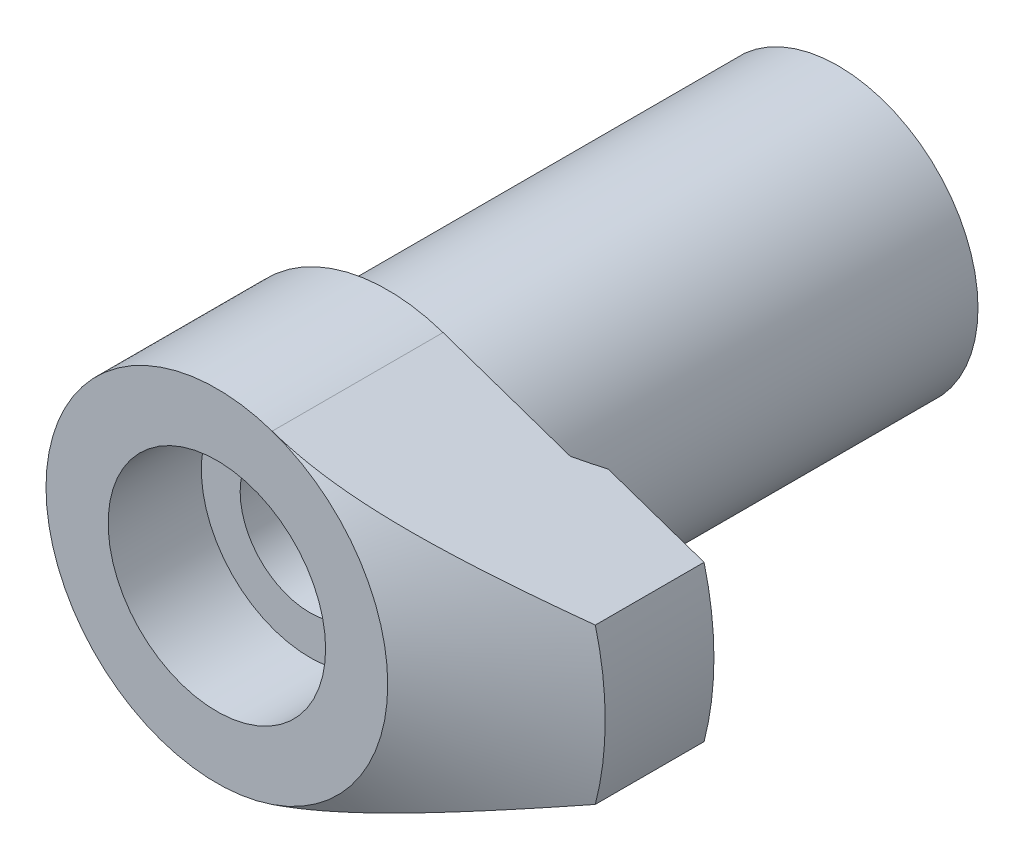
ISO-10303-21;
HEADER;
FILE_DESCRIPTION(('STEP AP214'),'2;1');
FILE_NAME('part.step','',(''),(''),'','','');
FILE_SCHEMA(('AUTOMOTIVE_DESIGN { 1 0 10303 214 1 1 1 1 }'));
ENDSEC;
DATA;
#1=APPLICATION_CONTEXT('core data for automotive mechanical design processes');
#2=APPLICATION_PROTOCOL_DEFINITION('international standard','automotive_design',2000,#1);
#3=PRODUCT_CONTEXT('',#1,'mechanical');
#4=PRODUCT('Part','Part','',(#3));
#5=PRODUCT_RELATED_PRODUCT_CATEGORY('part','',(#4));
#6=PRODUCT_DEFINITION_FORMATION('','',#4);
#7=PRODUCT_DEFINITION_CONTEXT('part definition',#1,'design');
#8=PRODUCT_DEFINITION('design','',#6,#7);
#9=PRODUCT_DEFINITION_SHAPE('','',#8);
#10=(LENGTH_UNIT() NAMED_UNIT(*) SI_UNIT(.MILLI.,.METRE.));
#11=(NAMED_UNIT(*) PLANE_ANGLE_UNIT() SI_UNIT($,.RADIAN.));
#12=(NAMED_UNIT(*) SI_UNIT($,.STERADIAN.) SOLID_ANGLE_UNIT());
#13=UNCERTAINTY_MEASURE_WITH_UNIT(LENGTH_MEASURE(1.E-05),#10,'distance_accuracy_value','');
#14=(GEOMETRIC_REPRESENTATION_CONTEXT(3) GLOBAL_UNCERTAINTY_ASSIGNED_CONTEXT((#13)) GLOBAL_UNIT_ASSIGNED_CONTEXT((#10,
#11,#12)) REPRESENTATION_CONTEXT('',''));
#15=CARTESIAN_POINT('',(0.,0.,0.));
#16=DIRECTION('',(0.,0.,1.));
#17=DIRECTION('',(1.,0.,0.));
#18=AXIS2_PLACEMENT_3D('',#15,#16,#17);
#19=CARTESIAN_POINT('',(19.3649167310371,5.,40.));
#20=DIRECTION('',(-0.323744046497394,-0.946144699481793,0.));
#21=DIRECTION('',(0.946144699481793,-0.323744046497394,0.));
#22=AXIS2_PLACEMENT_3D('',#19,#20,#21);
#23=PLANE('',#22);
#24=DIRECTION('',(0.946144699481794,-0.323744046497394,0.));
#25=VECTOR('',#24,1.);
#26=CARTESIAN_POINT('',(3.56118451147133,10.4075916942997,29.));
#27=LINE('',#26,#25);
#28=CARTESIAN_POINT('',(3.56118451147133,10.4075916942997,29.));
#29=VERTEX_POINT('',#28);
#30=CARTESIAN_POINT('',(11.7550379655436,7.60388600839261,29.));
#31=VERTEX_POINT('',#30);
#32=EDGE_CURVE('E75',#29,#31,#27,.T.);
#33=ORIENTED_EDGE('',*,*,#32,.F.);
#34=DIRECTION('',(0.,0.,-1.));
#35=VECTOR('',#34,1.);
#36=CARTESIAN_POINT('',(3.56118451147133,10.4075916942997,40.));
#37=LINE('',#36,#35);
#38=CARTESIAN_POINT('',(3.56118451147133,10.4075916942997,40.));
#39=VERTEX_POINT('',#38);
#40=EDGE_CURVE('E79',#39,#29,#37,.T.);
#41=ORIENTED_EDGE('',*,*,#40,.F.);
#42=CARTESIAN_POINT('',(19.3651167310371,4.99993156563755,34.9999019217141));
#43=CARTESIAN_POINT('',(19.1189011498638,5.08417959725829,35.1206409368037));
#44=CARTESIAN_POINT('',(18.8723799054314,5.16853221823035,35.2406833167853));
#45=CARTESIAN_POINT('',(18.378655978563,5.33747062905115,35.4792007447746));
#46=CARTESIAN_POINT('',(18.1314532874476,5.42205642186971,35.5976757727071));
#47=CARTESIAN_POINT('',(17.3886142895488,5.67623498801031,35.9505378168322));
#48=CARTESIAN_POINT('',(16.8918594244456,5.84621050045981,36.1823065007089));
#49=CARTESIAN_POINT('',(15.8908700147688,6.1887208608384,36.6387980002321));
#50=CARTESIAN_POINT('',(15.38660734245,6.36126533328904,36.8634521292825));
#51=CARTESIAN_POINT('',(14.3736636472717,6.70786611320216,37.3012836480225));
#52=CARTESIAN_POINT('',(13.8649829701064,6.8819223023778,37.5144619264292));
#53=CARTESIAN_POINT('',(12.8558826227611,7.2272079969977,37.920491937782));
#54=CARTESIAN_POINT('',(12.3556044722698,7.39838907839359,38.1137341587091));
#55=CARTESIAN_POINT('',(11.3489503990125,7.74283772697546,38.4820358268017));
#56=CARTESIAN_POINT('',(10.8425735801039,7.91610560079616,38.6570925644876));
#57=CARTESIAN_POINT('',(9.82459128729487,8.26443044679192,38.9830773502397));
#58=CARTESIAN_POINT('',(9.31300741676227,8.43948002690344,39.1340799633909));
#59=CARTESIAN_POINT('',(8.28274907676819,8.79200539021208,39.4059611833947));
#60=CARTESIAN_POINT('',(7.76407727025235,8.96948026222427,39.5268507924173));
#61=CARTESIAN_POINT('',(6.93982826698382,9.25151503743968,39.6882311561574));
#62=CARTESIAN_POINT('',(6.63641734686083,9.35533370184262,39.741148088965));
#63=CARTESIAN_POINT('',(6.02763820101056,9.56364076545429,39.8331116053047));
#64=CARTESIAN_POINT('',(5.72226960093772,9.66812929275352,39.872155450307));
#65=CARTESIAN_POINT('',(5.10799065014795,9.8783182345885,39.9354429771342));
#66=CARTESIAN_POINT('',(4.79907044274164,9.98402202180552,39.9595817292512));
#67=CARTESIAN_POINT('',(4.33512013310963,10.1427727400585,39.9837955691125));
#68=CARTESIAN_POINT('',(4.18035388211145,10.1957293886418,39.9898678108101));
#69=CARTESIAN_POINT('',(3.87072209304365,10.3016766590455,39.9979730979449));
#70=CARTESIAN_POINT('',(3.71585655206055,10.3546672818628,40.0000060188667));
#71=CARTESIAN_POINT('',(3.56098451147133,10.4076601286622,39.9999999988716));
#72=B_SPLINE_CURVE_WITH_KNOTS('',3,(#42,#43,#44,#45,#46,#47,#48,#49,#50,#51,#52,#53,#54,#55,#56,
#57,#58,#59,#60,#61,#62,#63,#64,#65,#66,#67,#68,#69,#70,#71),.UNSPECIFIED.,.F.,.F.,(4,2,2,2,2,2,
2,2,2,2,2,2,2,2,4),(0.,0.860625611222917,1.72126223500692,3.4429284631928,5.17796357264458,
6.9128641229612,8.60149286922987,10.2903728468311,11.9739110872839,13.6568333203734,
14.6316278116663,15.6066146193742,16.5883891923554,17.0794104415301,17.5704468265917),.UNSPECIFIED.);
#73=CARTESIAN_POINT('',(19.3649167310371,5.,35.));
#74=VERTEX_POINT('',#73);
#75=EDGE_CURVE('E142',#74,#39,#72,.T.);
#76=ORIENTED_EDGE('',*,*,#75,.F.);
#77=DIRECTION('',(0.,0.,-1.));
#78=VECTOR('',#77,1.);
#79=CARTESIAN_POINT('',(19.3649167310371,5.,40.));
#80=LINE('',#79,#78);
#81=CARTESIAN_POINT('',(19.3649167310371,5.,28.));
#82=VERTEX_POINT('',#81);
#83=EDGE_CURVE('E98',#74,#82,#80,.T.);
#84=ORIENTED_EDGE('',*,*,#83,.T.);
#85=DIRECTION('',(-0.946144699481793,0.323744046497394,0.));
#86=VECTOR('',#85,1.);
#87=CARTESIAN_POINT('',(19.3649167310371,5.,28.));
#88=LINE('',#87,#86);
#89=CARTESIAN_POINT('',(13.2100050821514,7.10603727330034,28.));
#90=VERTEX_POINT('',#89);
#91=EDGE_CURVE('E197',#82,#90,#88,.T.);
#92=ORIENTED_EDGE('',*,*,#91,.T.);
#93=CARTESIAN_POINT('',(23.8225206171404,3.4747335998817,18.9254021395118));
#94=CARTESIAN_POINT('',(23.5269580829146,3.57586676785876,19.2032639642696));
#95=CARTESIAN_POINT('',(23.2308068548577,3.67720137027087,19.4804279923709));
#96=CARTESIAN_POINT('',(22.6371636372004,3.88032934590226,20.0331547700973));
#97=CARTESIAN_POINT('',(22.3396716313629,3.98212272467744,20.3087175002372));
#98=CARTESIAN_POINT('',(21.7430806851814,4.18625932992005,20.8581305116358));
#99=CARTESIAN_POINT('',(21.443981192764,4.28860274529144,21.1319801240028));
#100=CARTESIAN_POINT('',(20.8440894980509,4.49386877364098,21.6775958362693));
#101=CARTESIAN_POINT('',(20.543297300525,4.59679138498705,21.9493619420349));
#102=CARTESIAN_POINT('',(19.62981066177,4.9093607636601,22.7685011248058));
#103=CARTESIAN_POINT('',(19.0141425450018,5.12002503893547,23.312194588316));
#104=CARTESIAN_POINT('',(18.0830184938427,5.43862944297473,24.1177590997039));
#105=CARTESIAN_POINT('',(17.7714030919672,5.54525544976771,24.3845934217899));
#106=CARTESIAN_POINT('',(17.1452054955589,5.75952261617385,24.9143498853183));
#107=CARTESIAN_POINT('',(16.8306233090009,5.86716377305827,25.1772720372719));
#108=CARTESIAN_POINT('',(16.2134223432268,6.07835254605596,25.6857928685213));
#109=CARTESIAN_POINT('',(15.9109663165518,6.18184447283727,25.9316119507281));
#110=CARTESIAN_POINT('',(15.302469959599,6.39005477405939,26.4182579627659));
#111=CARTESIAN_POINT('',(14.9964296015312,6.49477315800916,26.6590848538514));
#112=CARTESIAN_POINT('',(14.380009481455,6.70569474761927,27.1348982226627));
#113=CARTESIAN_POINT('',(14.0696271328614,6.81189883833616,27.3698809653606));
#114=CARTESIAN_POINT('',(13.444045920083,7.02595509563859,27.832580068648));
#115=CARTESIAN_POINT('',(13.1288471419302,7.13380723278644,28.0602965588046));
#116=CARTESIAN_POINT('',(12.4939671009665,7.35104528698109,28.5060566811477));
#117=CARTESIAN_POINT('',(12.1743055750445,7.46042445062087,28.7241316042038));
#118=CARTESIAN_POINT('',(11.5284990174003,7.68140125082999,29.1494069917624));
#119=CARTESIAN_POINT('',(11.2023533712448,7.79299909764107,29.3566064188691));
#120=CARTESIAN_POINT('',(10.5429830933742,8.01861702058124,29.7572101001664));
#121=CARTESIAN_POINT('',(10.2097663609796,8.13263439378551,29.950628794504));
#122=CARTESIAN_POINT('',(9.53501673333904,8.36351469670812,30.3204109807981));
#123=CARTESIAN_POINT('',(9.1934862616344,8.4803767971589,30.496779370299));
#124=CARTESIAN_POINT('',(8.52583347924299,8.70882875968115,30.8163307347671));
#125=CARTESIAN_POINT('',(8.20034552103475,8.82020156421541,30.9609824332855));
#126=CARTESIAN_POINT('',(7.54104904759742,9.0457942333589,31.2275642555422));
#127=CARTESIAN_POINT('',(7.20724056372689,9.16001408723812,31.3494944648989));
#128=CARTESIAN_POINT('',(6.53319028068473,9.39065509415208,31.5652989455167));
#129=CARTESIAN_POINT('',(6.19298575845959,9.50706349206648,31.6593014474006));
#130=CARTESIAN_POINT('',(5.50599141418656,9.74213359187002,31.8152095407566));
#131=CARTESIAN_POINT('',(5.15920246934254,9.86079499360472,31.8771193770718));
#132=CARTESIAN_POINT('',(4.45665752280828,10.101186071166,31.9655922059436));
#133=CARTESIAN_POINT('',(4.10084383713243,10.2229354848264,31.9916544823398));
#134=CARTESIAN_POINT('',(3.3885757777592,10.4666535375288,32.0049253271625));
#135=CARTESIAN_POINT('',(3.0321214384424,10.5886221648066,31.9921359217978));
#136=CARTESIAN_POINT('',(2.32116152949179,10.8318926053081,31.9285504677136));
#137=CARTESIAN_POINT('',(1.9666659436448,10.9531910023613,31.8776320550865));
#138=CARTESIAN_POINT('',(1.26374974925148,11.1937091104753,31.7411085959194));
#139=CARTESIAN_POINT('',(0.915330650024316,11.3129283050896,31.6554950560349));
#140=CARTESIAN_POINT('',(0.104046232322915,11.5905269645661,31.4187136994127));
#141=CARTESIAN_POINT('',(-0.355534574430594,11.7477825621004,31.2550634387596));
#142=CARTESIAN_POINT('',(-1.25915279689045,12.0569752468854,30.8854791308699));
#143=CARTESIAN_POINT('',(-1.70317927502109,12.2089085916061,30.6795160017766));
#144=CARTESIAN_POINT('',(-2.57753442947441,12.5080882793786,30.2355394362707));
#145=CARTESIAN_POINT('',(-3.00783403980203,12.6553246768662,29.99746293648));
#146=CARTESIAN_POINT('',(-3.85565904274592,12.9454264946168,29.4977073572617));
#147=CARTESIAN_POINT('',(-4.27318894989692,13.0882934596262,29.2360367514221));
#148=CARTESIAN_POINT('',(-4.82475924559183,13.277025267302,28.873978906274));
#149=CARTESIAN_POINT('',(-4.96350654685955,13.3245006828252,28.7814860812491));
#150=CARTESIAN_POINT('',(-5.23947978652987,13.418930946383,28.5948861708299));
#151=CARTESIAN_POINT('',(-5.37670889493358,13.4658868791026,28.5007843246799));
#152=CARTESIAN_POINT('',(-5.51341334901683,13.5126632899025,28.4058300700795));
#153=B_SPLINE_CURVE_WITH_KNOTS('',3,(#93,#94,#95,#96,#97,#98,#99,#100,#101,#102,#103,#104,#105,
#106,#107,#108,#109,#110,#111,#112,#113,#114,#115,#116,#117,#118,#119,#120,#121,#122,#123,#124,
#125,#126,#127,#128,#129,#130,#131,#132,#133,#134,#135,#136,#137,#138,#139,#140,#141,#142,#143,
#144,#145,#146,#147,#148,#149,#150,#151,#152),.UNSPECIFIED.,.F.,.F.,(4,2,2,2,2,2,2,2,2,2,2,2,2,
2,2,2,2,2,2,2,2,2,2,2,2,2,2,2,2,4),(0.,1.25424563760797,2.5085065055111,3.76322985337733,
5.01794966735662,7.56165901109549,8.83327508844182,10.1048877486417,11.3146219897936,
12.524365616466,13.7348635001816,14.9453397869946,16.1515456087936,17.3578662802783,
18.5629037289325,19.7675940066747,20.8865086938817,22.0054191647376,23.1191097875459,
24.2326530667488,25.3615974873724,26.4904830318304,27.6230070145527,28.7558084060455,
30.290783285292,31.8268167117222,33.3659117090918,34.9044561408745,35.4245803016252,
35.9432495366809),.UNSPECIFIED.);
#154=EDGE_CURVE('E82',#90,#31,#153,.T.);
#155=ORIENTED_EDGE('',*,*,#154,.T.);
#156=EDGE_LOOP('',(#33,#41,#76,#84,#92,#155));
#157=FACE_BOUND('',#156,.T.);
#158=ADVANCED_FACE('F14',(#157),#23,.F.);
#159=CARTESIAN_POINT('',(19.3649167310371,-5.,40.));
#160=DIRECTION('',(0.323744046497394,-0.946144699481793,0.));
#161=DIRECTION('',(0.946144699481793,0.323744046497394,0.));
#162=AXIS2_PLACEMENT_3D('',#159,#160,#161);
#163=PLANE('',#162);
#164=DIRECTION('',(0.,0.,-1.));
#165=VECTOR('',#164,1.);
#166=CARTESIAN_POINT('',(3.56118451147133,-10.4075916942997,40.));
#167=LINE('',#166,#165);
#168=CARTESIAN_POINT('',(3.56118451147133,-10.4075916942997,40.));
#169=VERTEX_POINT('',#168);
#170=CARTESIAN_POINT('',(3.56118451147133,-10.4075916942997,29.));
#171=VERTEX_POINT('',#170);
#172=EDGE_CURVE('E99',#169,#171,#167,.T.);
#173=ORIENTED_EDGE('',*,*,#172,.T.);
#174=DIRECTION('',(-0.946144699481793,-0.323744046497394,0.));
#175=VECTOR('',#174,1.);
#176=CARTESIAN_POINT('',(11.7550379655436,-7.6038860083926,29.));
#177=LINE('',#176,#175);
#178=CARTESIAN_POINT('',(11.7550379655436,-7.6038860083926,29.));
#179=VERTEX_POINT('',#178);
#180=EDGE_CURVE('E85',#179,#171,#177,.T.);
#181=ORIENTED_EDGE('',*,*,#180,.F.);
#182=CARTESIAN_POINT('',(23.8225206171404,-3.4747335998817,18.9254021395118));
#183=CARTESIAN_POINT('',(23.5269580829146,-3.57586676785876,19.2032639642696));
#184=CARTESIAN_POINT('',(23.2308068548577,-3.67720137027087,19.4804279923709));
#185=CARTESIAN_POINT('',(22.6371636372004,-3.88032934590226,20.0331547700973));
#186=CARTESIAN_POINT('',(22.3396716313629,-3.98212272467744,20.3087175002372));
#187=CARTESIAN_POINT('',(21.7430806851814,-4.18625932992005,20.8581305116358));
#188=CARTESIAN_POINT('',(21.443981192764,-4.28860274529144,21.1319801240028));
#189=CARTESIAN_POINT('',(20.8440894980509,-4.49386877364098,21.6775958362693));
#190=CARTESIAN_POINT('',(20.543297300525,-4.59679138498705,21.9493619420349));
#191=CARTESIAN_POINT('',(19.62981066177,-4.9093607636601,22.7685011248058));
#192=CARTESIAN_POINT('',(19.0141425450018,-5.12002503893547,23.312194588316));
#193=CARTESIAN_POINT('',(18.0830184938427,-5.43862944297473,24.1177590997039));
#194=CARTESIAN_POINT('',(17.7714030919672,-5.54525544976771,24.3845934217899));
#195=CARTESIAN_POINT('',(17.1452054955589,-5.75952261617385,24.9143498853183));
#196=CARTESIAN_POINT('',(16.8306233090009,-5.86716377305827,25.1772720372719));
#197=CARTESIAN_POINT('',(16.2134223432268,-6.07835254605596,25.6857928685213));
#198=CARTESIAN_POINT('',(15.9109663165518,-6.18184447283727,25.9316119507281));
#199=CARTESIAN_POINT('',(15.302469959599,-6.39005477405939,26.4182579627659));
#200=CARTESIAN_POINT('',(14.9964296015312,-6.49477315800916,26.6590848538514));
#201=CARTESIAN_POINT('',(14.380009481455,-6.70569474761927,27.1348982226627));
#202=CARTESIAN_POINT('',(14.0696271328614,-6.81189883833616,27.3698809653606));
#203=CARTESIAN_POINT('',(13.444045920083,-7.02595509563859,27.832580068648));
#204=CARTESIAN_POINT('',(13.1288471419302,-7.13380723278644,28.0602965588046));
#205=CARTESIAN_POINT('',(12.4939671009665,-7.35104528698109,28.5060566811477));
#206=CARTESIAN_POINT('',(12.1743055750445,-7.46042445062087,28.7241316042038));
#207=CARTESIAN_POINT('',(11.5284990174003,-7.68140125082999,29.1494069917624));
#208=CARTESIAN_POINT('',(11.2023533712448,-7.79299909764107,29.3566064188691));
#209=CARTESIAN_POINT('',(10.5429830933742,-8.01861702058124,29.7572101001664));
#210=CARTESIAN_POINT('',(10.2097663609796,-8.13263439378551,29.950628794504));
#211=CARTESIAN_POINT('',(9.53501673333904,-8.36351469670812,30.3204109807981));
#212=CARTESIAN_POINT('',(9.1934862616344,-8.4803767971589,30.496779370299));
#213=CARTESIAN_POINT('',(8.52583347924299,-8.70882875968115,30.8163307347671));
#214=CARTESIAN_POINT('',(8.20034552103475,-8.82020156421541,30.9609824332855));
#215=CARTESIAN_POINT('',(7.54104904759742,-9.0457942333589,31.2275642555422));
#216=CARTESIAN_POINT('',(7.20724056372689,-9.16001408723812,31.3494944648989));
#217=CARTESIAN_POINT('',(6.53319028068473,-9.39065509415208,31.5652989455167));
#218=CARTESIAN_POINT('',(6.19298575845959,-9.50706349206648,31.6593014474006));
#219=CARTESIAN_POINT('',(5.50599141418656,-9.74213359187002,31.8152095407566));
#220=CARTESIAN_POINT('',(5.15920246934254,-9.86079499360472,31.8771193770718));
#221=CARTESIAN_POINT('',(4.45665752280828,-10.101186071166,31.9655922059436));
#222=CARTESIAN_POINT('',(4.10084383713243,-10.2229354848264,31.9916544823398));
#223=CARTESIAN_POINT('',(3.3885757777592,-10.4666535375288,32.0049253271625));
#224=CARTESIAN_POINT('',(3.0321214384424,-10.5886221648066,31.9921359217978));
#225=CARTESIAN_POINT('',(2.32116152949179,-10.8318926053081,31.9285504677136));
#226=CARTESIAN_POINT('',(1.9666659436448,-10.9531910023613,31.8776320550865));
#227=CARTESIAN_POINT('',(1.26374974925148,-11.1937091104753,31.7411085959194));
#228=CARTESIAN_POINT('',(0.915330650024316,-11.3129283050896,31.6554950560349));
#229=CARTESIAN_POINT('',(0.104046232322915,-11.5905269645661,31.4187136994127));
#230=CARTESIAN_POINT('',(-0.355534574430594,-11.7477825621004,31.2550634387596));
#231=CARTESIAN_POINT('',(-1.25915279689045,-12.0569752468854,30.8854791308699));
#232=CARTESIAN_POINT('',(-1.70317927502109,-12.2089085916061,30.6795160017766));
#233=CARTESIAN_POINT('',(-2.57753442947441,-12.5080882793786,30.2355394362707));
#234=CARTESIAN_POINT('',(-3.00783403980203,-12.6553246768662,29.99746293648));
#235=CARTESIAN_POINT('',(-3.85565904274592,-12.9454264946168,29.4977073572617));
#236=CARTESIAN_POINT('',(-4.27318894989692,-13.0882934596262,29.2360367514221));
#237=CARTESIAN_POINT('',(-4.82475924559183,-13.277025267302,28.873978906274));
#238=CARTESIAN_POINT('',(-4.96350654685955,-13.3245006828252,28.7814860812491));
#239=CARTESIAN_POINT('',(-5.23947978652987,-13.418930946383,28.5948861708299));
#240=CARTESIAN_POINT('',(-5.37670889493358,-13.4658868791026,28.5007843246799));
#241=CARTESIAN_POINT('',(-5.51341334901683,-13.5126632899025,28.4058300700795));
#242=B_SPLINE_CURVE_WITH_KNOTS('',3,(#182,#183,#184,#185,#186,#187,#188,#189,#190,#191,#192,
#193,#194,#195,#196,#197,#198,#199,#200,#201,#202,#203,#204,#205,#206,#207,#208,#209,#210,#211,
#212,#213,#214,#215,#216,#217,#218,#219,#220,#221,#222,#223,#224,#225,#226,#227,#228,#229,#230,
#231,#232,#233,#234,#235,#236,#237,#238,#239,#240,#241),.UNSPECIFIED.,.F.,.F.,(4,2,2,2,2,2,2,2,
2,2,2,2,2,2,2,2,2,2,2,2,2,2,2,2,2,2,2,2,2,4),(0.,1.25424563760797,2.5085065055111,
3.76322985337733,5.01794966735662,7.56165901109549,8.83327508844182,10.1048877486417,
11.3146219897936,12.524365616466,13.7348635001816,14.9453397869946,16.1515456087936,
17.3578662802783,18.5629037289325,19.7675940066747,20.8865086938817,22.0054191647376,
23.1191097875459,24.2326530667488,25.3615974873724,26.4904830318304,27.6230070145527,
28.7558084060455,30.290783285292,31.8268167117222,33.3659117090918,34.9044561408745,
35.4245803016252,35.9432495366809),.UNSPECIFIED.);
#243=CARTESIAN_POINT('',(13.2100050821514,-7.10603727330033,28.));
#244=VERTEX_POINT('',#243);
#245=EDGE_CURVE('E9',#244,#179,#242,.T.);
#246=ORIENTED_EDGE('',*,*,#245,.F.);
#247=DIRECTION('',(-0.946144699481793,-0.323744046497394,0.));
#248=VECTOR('',#247,1.);
#249=CARTESIAN_POINT('',(19.3649167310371,-5.,28.));
#250=LINE('',#249,#248);
#251=CARTESIAN_POINT('',(19.3649167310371,-5.,28.));
#252=VERTEX_POINT('',#251);
#253=EDGE_CURVE('E28',#252,#244,#250,.T.);
#254=ORIENTED_EDGE('',*,*,#253,.F.);
#255=DIRECTION('',(0.,0.,-1.));
#256=VECTOR('',#255,1.);
#257=CARTESIAN_POINT('',(19.3649167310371,-5.,40.));
#258=LINE('',#257,#256);
#259=CARTESIAN_POINT('',(19.3649167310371,-5.,35.));
#260=VERTEX_POINT('',#259);
#261=EDGE_CURVE('E42',#260,#252,#258,.T.);
#262=ORIENTED_EDGE('',*,*,#261,.F.);
#263=CARTESIAN_POINT('',(19.3651167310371,-4.99993156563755,34.9999019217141));
#264=CARTESIAN_POINT('',(19.1189011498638,-5.08417959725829,35.1206409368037));
#265=CARTESIAN_POINT('',(18.8723799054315,-5.16853221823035,35.2406833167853));
#266=CARTESIAN_POINT('',(18.378655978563,-5.33747062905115,35.4792007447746));
#267=CARTESIAN_POINT('',(18.1314532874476,-5.42205642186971,35.5976757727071));
#268=CARTESIAN_POINT('',(17.3886142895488,-5.67623498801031,35.9505378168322));
#269=CARTESIAN_POINT('',(16.8918594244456,-5.84621050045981,36.1823065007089));
#270=CARTESIAN_POINT('',(15.8908700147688,-6.1887208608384,36.6387980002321));
#271=CARTESIAN_POINT('',(15.38660734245,-6.36126533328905,36.8634521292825));
#272=CARTESIAN_POINT('',(14.3736636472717,-6.70786611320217,37.3012836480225));
#273=CARTESIAN_POINT('',(13.8649829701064,-6.8819223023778,37.5144619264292));
#274=CARTESIAN_POINT('',(12.8558826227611,-7.2272079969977,37.920491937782));
#275=CARTESIAN_POINT('',(12.3556044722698,-7.3983890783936,38.1137341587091));
#276=CARTESIAN_POINT('',(11.3489503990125,-7.74283772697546,38.4820358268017));
#277=CARTESIAN_POINT('',(10.8425735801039,-7.91610560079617,38.6570925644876));
#278=CARTESIAN_POINT('',(9.82459128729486,-8.26443044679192,38.9830773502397));
#279=CARTESIAN_POINT('',(9.31300741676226,-8.43948002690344,39.1340799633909));
#280=CARTESIAN_POINT('',(8.28274907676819,-8.79200539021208,39.4059611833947));
#281=CARTESIAN_POINT('',(7.76407727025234,-8.96948026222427,39.5268507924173));
#282=CARTESIAN_POINT('',(6.93982826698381,-9.25151503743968,39.6882311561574));
#283=CARTESIAN_POINT('',(6.63641734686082,-9.35533370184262,39.741148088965));
#284=CARTESIAN_POINT('',(6.02763820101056,-9.56364076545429,39.8331116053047));
#285=CARTESIAN_POINT('',(5.72226960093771,-9.66812929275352,39.872155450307));
#286=CARTESIAN_POINT('',(5.10799065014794,-9.8783182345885,39.9354429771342));
#287=CARTESIAN_POINT('',(4.79907044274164,-9.98402202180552,39.9595817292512));
#288=CARTESIAN_POINT('',(4.33512013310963,-10.1427727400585,39.9837955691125));
#289=CARTESIAN_POINT('',(4.18035388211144,-10.1957293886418,39.9898678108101));
#290=CARTESIAN_POINT('',(3.87072209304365,-10.3016766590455,39.9979730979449));
#291=CARTESIAN_POINT('',(3.71585655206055,-10.3546672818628,40.0000060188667));
#292=CARTESIAN_POINT('',(3.56098451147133,-10.4076601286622,39.9999999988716));
#293=B_SPLINE_CURVE_WITH_KNOTS('',3,(#263,#264,#265,#266,#267,#268,#269,#270,#271,#272,#273,
#274,#275,#276,#277,#278,#279,#280,#281,#282,#283,#284,#285,#286,#287,#288,#289,#290,#291,#292),
.UNSPECIFIED.,.F.,.F.,(4,2,2,2,2,2,2,2,2,2,2,2,2,2,4),(0.,0.860625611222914,1.72126223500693,
3.44292846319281,5.17796357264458,6.91286412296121,8.60149286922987,10.2903728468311,
11.9739110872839,13.6568333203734,14.6316278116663,15.6066146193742,16.5883891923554,
17.0794104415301,17.5704468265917),.UNSPECIFIED.);
#294=EDGE_CURVE('E134',#260,#169,#293,.T.);
#295=ORIENTED_EDGE('',*,*,#294,.T.);
#296=EDGE_LOOP('',(#173,#181,#246,#254,#262,#295));
#297=FACE_BOUND('',#296,.T.);
#298=ADVANCED_FACE('F148',(#297),#163,.T.);
#299=CARTESIAN_POINT('',(0.,0.,40.));
#300=DIRECTION('',(0.,0.,-1.));
#301=DIRECTION('',(-1.,0.,0.));
#302=AXIS2_PLACEMENT_3D('',#299,#300,#301);
#303=CYLINDRICAL_SURFACE('',#302,11.);
#304=CARTESIAN_POINT('',(0.,0.,29.));
#305=DIRECTION('',(0.,0.,1.));
#306=DIRECTION('',(1.,0.,0.));
#307=AXIS2_PLACEMENT_3D('',#304,#305,#306);
#308=CIRCLE('',#307,11.);
#309=EDGE_CURVE('E88',#29,#171,#308,.T.);
#310=ORIENTED_EDGE('',*,*,#309,.T.);
#311=ORIENTED_EDGE('',*,*,#172,.F.);
#312=CARTESIAN_POINT('',(0.,0.,40.));
#313=DIRECTION('',(0.,0.,1.));
#314=DIRECTION('',(1.,0.,0.));
#315=AXIS2_PLACEMENT_3D('',#312,#313,#314);
#316=CIRCLE('',#315,11.);
#317=EDGE_CURVE('E97',#39,#169,#316,.T.);
#318=ORIENTED_EDGE('',*,*,#317,.F.);
#319=ORIENTED_EDGE('',*,*,#40,.T.);
#320=EDGE_LOOP('',(#310,#311,#318,#319));
#321=FACE_BOUND('',#320,.T.);
#322=ADVANCED_FACE('F96',(#321),#303,.T.);
#323=CARTESIAN_POINT('',(30.,20.,28.));
#324=DIRECTION('',(0.,0.,1.));
#325=DIRECTION('',(1.,0.,0.));
#326=AXIS2_PLACEMENT_3D('',#323,#324,#325);
#327=PLANE('',#326);
#328=ORIENTED_EDGE('',*,*,#253,.T.);
#329=CARTESIAN_POINT('',(0.,0.,28.));
#330=DIRECTION('',(0.,0.,1.));
#331=DIRECTION('',(1.,0.,0.));
#332=AXIS2_PLACEMENT_3D('',#329,#330,#331);
#333=CIRCLE('',#332,15.);
#334=EDGE_CURVE('E34',#244,#90,#333,.T.);
#335=ORIENTED_EDGE('',*,*,#334,.T.);
#336=ORIENTED_EDGE('',*,*,#91,.F.);
#337=CARTESIAN_POINT('',(0.,0.,28.));
#338=DIRECTION('',(0.,0.,1.));
#339=DIRECTION('',(1.,0.,0.));
#340=AXIS2_PLACEMENT_3D('',#337,#338,#339);
#341=CIRCLE('',#340,20.);
#342=EDGE_CURVE('E195',#252,#82,#341,.T.);
#343=ORIENTED_EDGE('',*,*,#342,.F.);
#344=EDGE_LOOP('',(#328,#335,#336,#343));
#345=FACE_BOUND('',#344,.T.);
#346=ADVANCED_FACE('F166',(#345),#327,.F.);
#347=CARTESIAN_POINT('',(0.,0.,0.));
#348=DIRECTION('',(0.,0.,-1.));
#349=DIRECTION('',(-1.,0.,0.));
#350=AXIS2_PLACEMENT_3D('',#347,#348,#349);
#351=CYLINDRICAL_SURFACE('',#350,4.5);
#352=CARTESIAN_POINT('',(0.,0.,24.));
#353=DIRECTION('',(0.,0.,-1.));
#354=DIRECTION('',(-1.,0.,0.));
#355=AXIS2_PLACEMENT_3D('',#352,#353,#354);
#356=CIRCLE('',#355,4.5);
#357=CARTESIAN_POINT('',(-4.5,0.,24.));
#358=VERTEX_POINT('',#357);
#359=EDGE_CURVE('E126',#358,#358,#356,.T.);
#360=ORIENTED_EDGE('',*,*,#359,.T.);
#361=EDGE_LOOP('',(#360));
#362=FACE_BOUND('',#361,.T.);
#363=CARTESIAN_POINT('',(0.,0.,34.));
#364=DIRECTION('',(0.,0.,1.));
#365=DIRECTION('',(1.,0.,0.));
#366=AXIS2_PLACEMENT_3D('',#363,#364,#365);
#367=CIRCLE('',#366,4.5);
#368=CARTESIAN_POINT('',(4.5,0.,34.));
#369=VERTEX_POINT('',#368);
#370=EDGE_CURVE('E106',#369,#369,#367,.T.);
#371=ORIENTED_EDGE('',*,*,#370,.T.);
#372=EDGE_LOOP('',(#371));
#373=FACE_BOUND('',#372,.T.);
#374=ADVANCED_FACE('F159',(#362,#373),#351,.F.);
#375=CARTESIAN_POINT('',(0.,0.,0.));
#376=DIRECTION('',(0.,0.,1.));
#377=DIRECTION('',(1.,0.,0.));
#378=AXIS2_PLACEMENT_3D('',#375,#376,#377);
#379=PLANE('',#378);
#380=CARTESIAN_POINT('',(0.,0.,0.));
#381=DIRECTION('',(0.,0.,-1.));
#382=DIRECTION('',(-1.,0.,0.));
#383=AXIS2_PLACEMENT_3D('',#380,#381,#382);
#384=CIRCLE('',#383,9.);
#385=CARTESIAN_POINT('',(-9.,0.,0.));
#386=VERTEX_POINT('',#385);
#387=EDGE_CURVE('E198',#386,#386,#384,.T.);
#388=ORIENTED_EDGE('',*,*,#387,.T.);
#389=EDGE_LOOP('',(#388));
#390=FACE_BOUND('',#389,.T.);
#391=CARTESIAN_POINT('',(0.,0.,0.));
#392=DIRECTION('',(0.,0.,-1.));
#393=DIRECTION('',(-1.,0.,0.));
#394=AXIS2_PLACEMENT_3D('',#391,#392,#393);
#395=CIRCLE('',#394,7.);
#396=CARTESIAN_POINT('',(-7.,0.,0.));
#397=VERTEX_POINT('',#396);
#398=EDGE_CURVE('E108',#397,#397,#395,.T.);
#399=ORIENTED_EDGE('',*,*,#398,.F.);
#400=EDGE_LOOP('',(#399));
#401=FACE_BOUND('',#400,.T.);
#402=ADVANCED_FACE('F170',(#390,#401),#379,.F.);
#403=CARTESIAN_POINT('',(0.,0.,40.));
#404=DIRECTION('',(0.,0.,1.));
#405=DIRECTION('',(1.,0.,0.));
#406=AXIS2_PLACEMENT_3D('',#403,#404,#405);
#407=PLANE('',#406);
#408=CARTESIAN_POINT('',(0.,0.,40.));
#409=DIRECTION('',(0.,0.,1.));
#410=DIRECTION('',(1.,0.,0.));
#411=AXIS2_PLACEMENT_3D('',#408,#409,#410);
#412=CIRCLE('',#411,7.);
#413=CARTESIAN_POINT('',(7.,0.,40.));
#414=VERTEX_POINT('',#413);
#415=EDGE_CURVE('E116',#414,#414,#412,.T.);
#416=ORIENTED_EDGE('',*,*,#415,.F.);
#417=EDGE_LOOP('',(#416));
#418=FACE_BOUND('',#417,.T.);
#419=ORIENTED_EDGE('',*,*,#317,.T.);
#420=CARTESIAN_POINT('',(0.,0.,40.));
#421=DIRECTION('',(0.,0.,1.));
#422=DIRECTION('',(1.,0.,0.));
#423=AXIS2_PLACEMENT_3D('',#420,#421,#422);
#424=CIRCLE('',#423,11.);
#425=EDGE_CURVE('E131',#169,#39,#424,.T.);
#426=ORIENTED_EDGE('',*,*,#425,.T.);
#427=EDGE_LOOP('',(#419,#426));
#428=FACE_BOUND('',#427,.T.);
#429=ADVANCED_FACE('F173',(#418,#428),#407,.T.);
#430=CARTESIAN_POINT('',(0.,0.,40.));
#431=DIRECTION('',(0.,0.,-1.));
#432=DIRECTION('',(-1.,0.,0.));
#433=AXIS2_PLACEMENT_3D('',#430,#431,#432);
#434=CYLINDRICAL_SURFACE('',#433,20.);
#435=CARTESIAN_POINT('',(0.,0.,35.));
#436=DIRECTION('',(0.,0.,1.));
#437=DIRECTION('',(1.,0.,0.));
#438=AXIS2_PLACEMENT_3D('',#435,#436,#437);
#439=CIRCLE('',#438,20.);
#440=EDGE_CURVE('E129',#260,#74,#439,.T.);
#441=ORIENTED_EDGE('',*,*,#440,.F.);
#442=ORIENTED_EDGE('',*,*,#261,.T.);
#443=ORIENTED_EDGE('',*,*,#342,.T.);
#444=ORIENTED_EDGE('',*,*,#83,.F.);
#445=EDGE_LOOP('',(#441,#442,#443,#444));
#446=FACE_BOUND('',#445,.T.);
#447=ADVANCED_FACE('F164',(#446),#434,.T.);
#448=CARTESIAN_POINT('',(0.,0.,28.));
#449=DIRECTION('',(0.,0.,-1.));
#450=DIRECTION('',(-1.,0.,0.));
#451=AXIS2_PLACEMENT_3D('',#448,#449,#450);
#452=CYLINDRICAL_SURFACE('',#451,9.);
#453=ORIENTED_EDGE('',*,*,#387,.F.);
#454=EDGE_LOOP('',(#453));
#455=FACE_BOUND('',#454,.T.);
#456=CARTESIAN_POINT('',(0.,0.,29.));
#457=DIRECTION('',(0.,0.,1.));
#458=DIRECTION('',(1.,0.,0.));
#459=AXIS2_PLACEMENT_3D('',#456,#457,#458);
#460=CIRCLE('',#459,9.);
#461=CARTESIAN_POINT('',(9.,0.,29.));
#462=VERTEX_POINT('',#461);
#463=EDGE_CURVE('E94',#462,#462,#460,.T.);
#464=ORIENTED_EDGE('',*,*,#463,.F.);
#465=EDGE_LOOP('',(#464));
#466=FACE_BOUND('',#465,.T.);
#467=ADVANCED_FACE('F157',(#455,#466),#452,.T.);
#468=CARTESIAN_POINT('',(0.,0.,40.));
#469=DIRECTION('',(0.,0.,-1.));
#470=DIRECTION('',(-1.,0.,0.));
#471=AXIS2_PLACEMENT_3D('',#468,#469,#470);
#472=CONICAL_SURFACE('',#471,11.,1.06369782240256);
#473=ORIENTED_EDGE('',*,*,#75,.T.);
#474=ORIENTED_EDGE('',*,*,#425,.F.);
#475=ORIENTED_EDGE('',*,*,#294,.F.);
#476=ORIENTED_EDGE('',*,*,#440,.T.);
#477=EDGE_LOOP('',(#473,#474,#475,#476));
#478=FACE_BOUND('',#477,.T.);
#479=ADVANCED_FACE('F151',(#478),#472,.T.);
#480=CARTESIAN_POINT('',(4.5,0.,24.));
#481=DIRECTION('',(0.,0.,-1.));
#482=DIRECTION('',(-1.,0.,0.));
#483=AXIS2_PLACEMENT_3D('',#480,#481,#482);
#484=PLANE('',#483);
#485=CARTESIAN_POINT('',(0.,0.,24.));
#486=DIRECTION('',(0.,0.,-1.));
#487=DIRECTION('',(-1.,0.,0.));
#488=AXIS2_PLACEMENT_3D('',#485,#486,#487);
#489=CIRCLE('',#488,7.);
#490=CARTESIAN_POINT('',(-7.,0.,24.));
#491=VERTEX_POINT('',#490);
#492=EDGE_CURVE('E113',#491,#491,#489,.T.);
#493=ORIENTED_EDGE('',*,*,#492,.T.);
#494=EDGE_LOOP('',(#493));
#495=FACE_BOUND('',#494,.T.);
#496=ORIENTED_EDGE('',*,*,#359,.F.);
#497=EDGE_LOOP('',(#496));
#498=FACE_BOUND('',#497,.T.);
#499=ADVANCED_FACE('F156',(#495,#498),#484,.T.);
#500=CARTESIAN_POINT('',(0.,0.,0.));
#501=DIRECTION('',(0.,0.,-1.));
#502=DIRECTION('',(-1.,0.,0.));
#503=AXIS2_PLACEMENT_3D('',#500,#501,#502);
#504=CYLINDRICAL_SURFACE('',#503,7.);
#505=ORIENTED_EDGE('',*,*,#398,.T.);
#506=EDGE_LOOP('',(#505));
#507=FACE_BOUND('',#506,.T.);
#508=ORIENTED_EDGE('',*,*,#492,.F.);
#509=EDGE_LOOP('',(#508));
#510=FACE_BOUND('',#509,.T.);
#511=ADVANCED_FACE('F230',(#507,#510),#504,.F.);
#512=CARTESIAN_POINT('',(0.,0.,34.));
#513=DIRECTION('',(0.,0.,1.));
#514=DIRECTION('',(1.,0.,0.));
#515=AXIS2_PLACEMENT_3D('',#512,#513,#514);
#516=CYLINDRICAL_SURFACE('',#515,7.);
#517=CARTESIAN_POINT('',(0.,0.,34.));
#518=DIRECTION('',(0.,0.,1.));
#519=DIRECTION('',(1.,0.,0.));
#520=AXIS2_PLACEMENT_3D('',#517,#518,#519);
#521=CIRCLE('',#520,7.);
#522=CARTESIAN_POINT('',(7.,0.,34.));
#523=VERTEX_POINT('',#522);
#524=EDGE_CURVE('E109',#523,#523,#521,.T.);
#525=ORIENTED_EDGE('',*,*,#524,.F.);
#526=EDGE_LOOP('',(#525));
#527=FACE_BOUND('',#526,.T.);
#528=ORIENTED_EDGE('',*,*,#415,.T.);
#529=EDGE_LOOP('',(#528));
#530=FACE_BOUND('',#529,.T.);
#531=ADVANCED_FACE('F226',(#527,#530),#516,.F.);
#532=CARTESIAN_POINT('',(0.,0.,34.));
#533=DIRECTION('',(0.,0.,1.));
#534=DIRECTION('',(1.,0.,0.));
#535=AXIS2_PLACEMENT_3D('',#532,#533,#534);
#536=PLANE('',#535);
#537=ORIENTED_EDGE('',*,*,#370,.F.);
#538=EDGE_LOOP('',(#537));
#539=FACE_BOUND('',#538,.T.);
#540=ORIENTED_EDGE('',*,*,#524,.T.);
#541=EDGE_LOOP('',(#540));
#542=FACE_BOUND('',#541,.T.);
#543=ADVANCED_FACE('F225',(#539,#542),#536,.T.);
#544=CARTESIAN_POINT('',(-9.,0.,29.));
#545=DIRECTION('',(0.,0.,-1.));
#546=DIRECTION('',(-1.,0.,0.));
#547=AXIS2_PLACEMENT_3D('',#544,#545,#546);
#548=PLANE('',#547);
#549=ORIENTED_EDGE('',*,*,#463,.T.);
#550=EDGE_LOOP('',(#549));
#551=FACE_BOUND('',#550,.T.);
#552=ORIENTED_EDGE('',*,*,#309,.F.);
#553=ORIENTED_EDGE('',*,*,#32,.T.);
#554=CARTESIAN_POINT('',(0.,0.,29.));
#555=DIRECTION('',(0.,0.,1.));
#556=DIRECTION('',(1.,0.,0.));
#557=AXIS2_PLACEMENT_3D('',#554,#555,#556);
#558=CIRCLE('',#557,14.);
#559=EDGE_CURVE('E216',#179,#31,#558,.T.);
#560=ORIENTED_EDGE('',*,*,#559,.F.);
#561=ORIENTED_EDGE('',*,*,#180,.T.);
#562=EDGE_LOOP('',(#552,#553,#560,#561));
#563=FACE_BOUND('',#562,.T.);
#564=ADVANCED_FACE('F89',(#551,#563),#548,.T.);
#565=CARTESIAN_POINT('',(0.,0.,29.));
#566=DIRECTION('',(0.,0.,-1.));
#567=DIRECTION('',(-1.,0.,0.));
#568=AXIS2_PLACEMENT_3D('',#565,#566,#567);
#569=CONICAL_SURFACE('',#568,14.,0.785398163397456);
#570=ORIENTED_EDGE('',*,*,#334,.F.);
#571=ORIENTED_EDGE('',*,*,#245,.T.);
#572=ORIENTED_EDGE('',*,*,#559,.T.);
#573=ORIENTED_EDGE('',*,*,#154,.F.);
#574=EDGE_LOOP('',(#570,#571,#572,#573));
#575=FACE_BOUND('',#574,.T.);
#576=ADVANCED_FACE('F218',(#575),#569,.F.);
#577=CLOSED_SHELL('',(#158,#298,#322,#346,#374,#402,#429,#447,#467,#479,#499,#511,#531,#543,
#564,#576));
#578=MANIFOLD_SOLID_BREP('B1',#577);
#579=ADVANCED_BREP_SHAPE_REPRESENTATION('',(#18,#578),#14);
#580=SHAPE_DEFINITION_REPRESENTATION(#9,#579);
ENDSEC;
END-ISO-10303-21;
